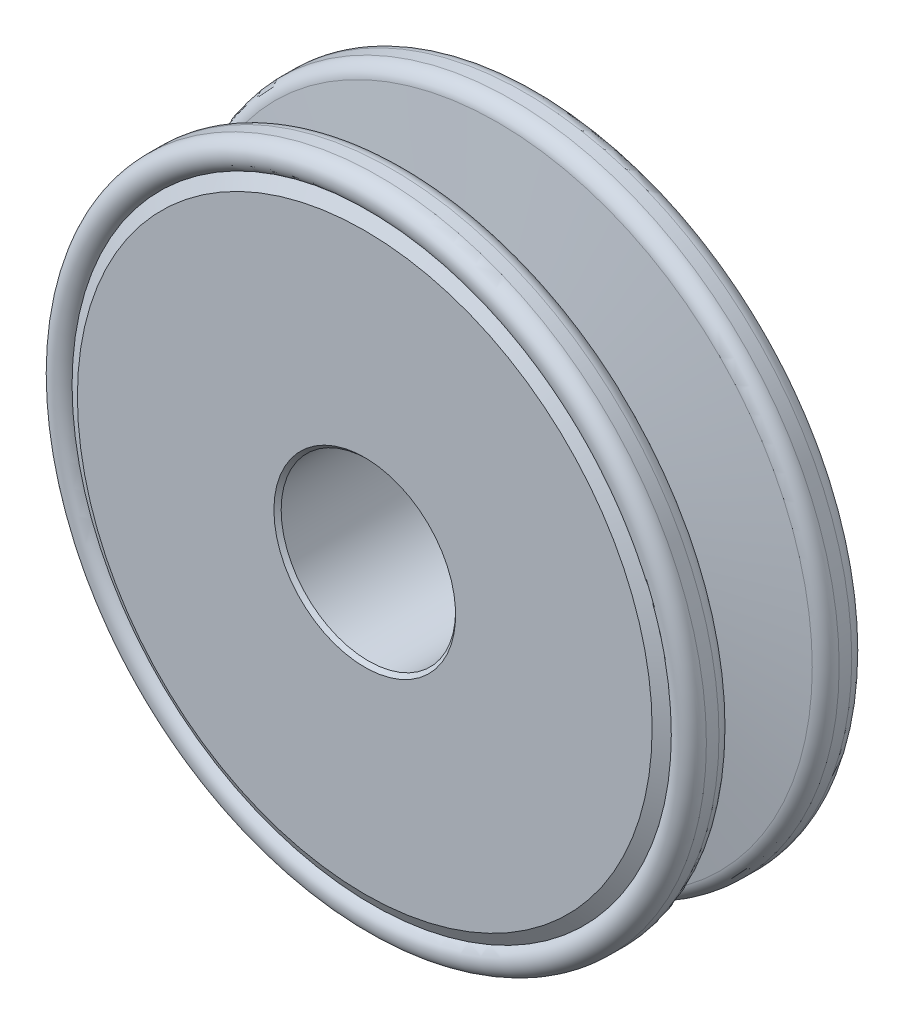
ISO-10303-21;
HEADER;
FILE_DESCRIPTION(('STEP AP214'),'2;1');
FILE_NAME('part.step','',(''),(''),'','','');
FILE_SCHEMA(('AUTOMOTIVE_DESIGN { 1 0 10303 214 1 1 1 1 }'));
ENDSEC;
DATA;
#1=APPLICATION_CONTEXT('core data for automotive mechanical design processes');
#2=APPLICATION_PROTOCOL_DEFINITION('international standard','automotive_design',2000,#1);
#3=PRODUCT_CONTEXT('',#1,'mechanical');
#4=PRODUCT('Part','Part','',(#3));
#5=PRODUCT_RELATED_PRODUCT_CATEGORY('part','',(#4));
#6=PRODUCT_DEFINITION_FORMATION('','',#4);
#7=PRODUCT_DEFINITION_CONTEXT('part definition',#1,'design');
#8=PRODUCT_DEFINITION('design','',#6,#7);
#9=PRODUCT_DEFINITION_SHAPE('','',#8);
#10=(LENGTH_UNIT() NAMED_UNIT(*) SI_UNIT(.MILLI.,.METRE.));
#11=(NAMED_UNIT(*) PLANE_ANGLE_UNIT() SI_UNIT($,.RADIAN.));
#12=(NAMED_UNIT(*) SI_UNIT($,.STERADIAN.) SOLID_ANGLE_UNIT());
#13=UNCERTAINTY_MEASURE_WITH_UNIT(LENGTH_MEASURE(1.E-05),#10,'distance_accuracy_value','');
#14=(GEOMETRIC_REPRESENTATION_CONTEXT(3) GLOBAL_UNCERTAINTY_ASSIGNED_CONTEXT((#13)) GLOBAL_UNIT_ASSIGNED_CONTEXT((#10,
#11,#12)) REPRESENTATION_CONTEXT('',''));
#15=CARTESIAN_POINT('',(0.,0.,0.));
#16=DIRECTION('',(0.,0.,1.));
#17=DIRECTION('',(1.,0.,0.));
#18=AXIS2_PLACEMENT_3D('',#15,#16,#17);
#19=CARTESIAN_POINT('',(0.,6.,6.));
#20=DIRECTION('',(0.,0.,-1.));
#21=DIRECTION('',(-1.,0.,0.));
#22=AXIS2_PLACEMENT_3D('',#19,#20,#21);
#23=PLANE('',#22);
#24=CARTESIAN_POINT('',(0.,0.,6.));
#25=DIRECTION('',(0.,0.,-1.));
#26=DIRECTION('',(-1.,0.,0.));
#27=AXIS2_PLACEMENT_3D('',#24,#25,#26);
#28=CIRCLE('',#27,6.24999999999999);
#29=CARTESIAN_POINT('',(-6.24999999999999,0.,6.));
#30=VERTEX_POINT('',#29);
#31=EDGE_CURVE('E36',#30,#30,#28,.T.);
#32=ORIENTED_EDGE('',*,*,#31,.T.);
#33=EDGE_LOOP('',(#32));
#34=FACE_BOUND('',#33,.T.);
#35=CARTESIAN_POINT('',(0.,0.,6.));
#36=DIRECTION('',(0.,0.,1.));
#37=DIRECTION('',(1.,0.,0.));
#38=AXIS2_PLACEMENT_3D('',#35,#36,#37);
#39=CIRCLE('',#38,19.7679491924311);
#40=CARTESIAN_POINT('',(19.7679491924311,0.,6.));
#41=VERTEX_POINT('',#40);
#42=EDGE_CURVE('E82',#41,#41,#39,.T.);
#43=ORIENTED_EDGE('',*,*,#42,.T.);
#44=EDGE_LOOP('',(#43));
#45=FACE_BOUND('',#44,.T.);
#46=ADVANCED_FACE('F29',(#34,#45),#23,.F.);
#47=CARTESIAN_POINT('',(0.,0.,6.));
#48=DIRECTION('',(0.,0.,1.));
#49=DIRECTION('',(1.,0.,0.));
#50=AXIS2_PLACEMENT_3D('',#47,#48,#49);
#51=CYLINDRICAL_SURFACE('',#50,6.);
#52=CARTESIAN_POINT('',(0.,0.,5.75000000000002));
#53=DIRECTION('',(0.,0.,-1.));
#54=DIRECTION('',(-1.,0.,0.));
#55=AXIS2_PLACEMENT_3D('',#52,#53,#54);
#56=CIRCLE('',#55,6.);
#57=CARTESIAN_POINT('',(-6.,0.,5.75000000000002));
#58=VERTEX_POINT('',#57);
#59=EDGE_CURVE('E40',#58,#58,#56,.F.);
#60=ORIENTED_EDGE('',*,*,#59,.T.);
#61=EDGE_LOOP('',(#60));
#62=FACE_BOUND('',#61,.T.);
#63=CARTESIAN_POINT('',(0.,0.,-5.75));
#64=DIRECTION('',(0.,0.,1.));
#65=DIRECTION('',(1.,0.,0.));
#66=AXIS2_PLACEMENT_3D('',#63,#64,#65);
#67=CIRCLE('',#66,6.);
#68=CARTESIAN_POINT('',(6.,0.,-5.75));
#69=VERTEX_POINT('',#68);
#70=EDGE_CURVE('E44',#69,#69,#67,.F.);
#71=ORIENTED_EDGE('',*,*,#70,.T.);
#72=EDGE_LOOP('',(#71));
#73=FACE_BOUND('',#72,.T.);
#74=ADVANCED_FACE('F156',(#62,#73),#51,.F.);
#75=CARTESIAN_POINT('',(0.,6.,-6.));
#76=DIRECTION('',(0.,0.,1.));
#77=DIRECTION('',(1.,0.,0.));
#78=AXIS2_PLACEMENT_3D('',#75,#76,#77);
#79=PLANE('',#78);
#80=CARTESIAN_POINT('',(0.,0.,-6.));
#81=DIRECTION('',(0.,0.,1.));
#82=DIRECTION('',(1.,0.,0.));
#83=AXIS2_PLACEMENT_3D('',#80,#81,#82);
#84=CIRCLE('',#83,6.25);
#85=CARTESIAN_POINT('',(6.25,0.,-6.));
#86=VERTEX_POINT('',#85);
#87=EDGE_CURVE('E10',#86,#86,#84,.T.);
#88=ORIENTED_EDGE('',*,*,#87,.T.);
#89=EDGE_LOOP('',(#88));
#90=FACE_BOUND('',#89,.T.);
#91=CARTESIAN_POINT('',(0.,0.,-6.));
#92=DIRECTION('',(0.,0.,1.));
#93=DIRECTION('',(1.,0.,0.));
#94=AXIS2_PLACEMENT_3D('',#91,#92,#93);
#95=CIRCLE('',#94,19.7679491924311);
#96=CARTESIAN_POINT('',(19.7679491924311,0.,-6.));
#97=VERTEX_POINT('',#96);
#98=EDGE_CURVE('E49',#97,#97,#95,.T.);
#99=ORIENTED_EDGE('',*,*,#98,.F.);
#100=EDGE_LOOP('',(#99));
#101=FACE_BOUND('',#100,.T.);
#102=ADVANCED_FACE('F151',(#90,#101),#79,.F.);
#103=CARTESIAN_POINT('',(0.,0.,-6.));
#104=DIRECTION('',(0.,0.,1.));
#105=DIRECTION('',(1.,0.,0.));
#106=AXIS2_PLACEMENT_3D('',#103,#104,#105);
#107=CONICAL_SURFACE('',#106,19.7679491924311,1.0471975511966);
#108=CARTESIAN_POINT('',(0.,0.,-5.5));
#109=DIRECTION('',(0.,0.,1.));
#110=DIRECTION('',(1.,0.,0.));
#111=AXIS2_PLACEMENT_3D('',#108,#109,#110);
#112=CIRCLE('',#111,20.6339745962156);
#113=CARTESIAN_POINT('',(20.6339745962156,0.,-5.5));
#114=VERTEX_POINT('',#113);
#115=EDGE_CURVE('E52',#114,#114,#112,.T.);
#116=ORIENTED_EDGE('',*,*,#115,.F.);
#117=EDGE_LOOP('',(#116));
#118=FACE_BOUND('',#117,.T.);
#119=ORIENTED_EDGE('',*,*,#98,.T.);
#120=EDGE_LOOP('',(#119));
#121=FACE_BOUND('',#120,.T.);
#122=ADVANCED_FACE('F145',(#118,#121),#107,.T.);
#123=CARTESIAN_POINT('',(0.,0.,-5.));
#124=DIRECTION('',(0.,0.,1.));
#125=DIRECTION('',(1.,0.,0.));
#126=AXIS2_PLACEMENT_3D('',#123,#124,#125);
#127=TOROIDAL_SURFACE('',#126,21.5,1.);
#128=CARTESIAN_POINT('',(0.,0.,-5.));
#129=DIRECTION('',(0.,0.,1.));
#130=DIRECTION('',(1.,0.,0.));
#131=AXIS2_PLACEMENT_3D('',#128,#129,#130);
#132=CIRCLE('',#131,22.5);
#133=CARTESIAN_POINT('',(22.5,0.,-5.));
#134=VERTEX_POINT('',#133);
#135=EDGE_CURVE('E55',#134,#134,#132,.T.);
#136=ORIENTED_EDGE('',*,*,#135,.F.);
#137=EDGE_LOOP('',(#136));
#138=FACE_BOUND('',#137,.T.);
#139=ORIENTED_EDGE('',*,*,#115,.T.);
#140=EDGE_LOOP('',(#139));
#141=FACE_BOUND('',#140,.T.);
#142=ADVANCED_FACE('F139',(#138,#141),#127,.T.);
#143=CARTESIAN_POINT('',(0.,0.,6.));
#144=DIRECTION('',(0.,0.,1.));
#145=DIRECTION('',(1.,0.,0.));
#146=AXIS2_PLACEMENT_3D('',#143,#144,#145);
#147=CYLINDRICAL_SURFACE('',#146,22.5);
#148=CARTESIAN_POINT('',(0.,0.,-4.13415425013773));
#149=DIRECTION('',(0.,0.,1.));
#150=DIRECTION('',(1.,0.,0.));
#151=AXIS2_PLACEMENT_3D('',#148,#149,#150);
#152=CIRCLE('',#151,22.5);
#153=CARTESIAN_POINT('',(22.5,0.,-4.13415425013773));
#154=VERTEX_POINT('',#153);
#155=EDGE_CURVE('E58',#154,#154,#152,.T.);
#156=ORIENTED_EDGE('',*,*,#155,.F.);
#157=EDGE_LOOP('',(#156));
#158=FACE_BOUND('',#157,.T.);
#159=ORIENTED_EDGE('',*,*,#135,.T.);
#160=EDGE_LOOP('',(#159));
#161=FACE_BOUND('',#160,.T.);
#162=ADVANCED_FACE('F133',(#158,#161),#147,.T.);
#163=CARTESIAN_POINT('',(0.,0.,-4.13415425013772));
#164=DIRECTION('',(0.,0.,1.));
#165=DIRECTION('',(1.,0.,0.));
#166=AXIS2_PLACEMENT_3D('',#163,#164,#165);
#167=TOROIDAL_SURFACE('',#166,21.5,1.);
#168=CARTESIAN_POINT('',(0.,0.,-3.14388618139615));
#169=DIRECTION('',(0.,0.,1.));
#170=DIRECTION('',(1.,0.,0.));
#171=AXIS2_PLACEMENT_3D('',#168,#169,#170);
#172=CIRCLE('',#171,21.6391731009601);
#173=CARTESIAN_POINT('',(21.6391731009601,0.,-3.14388618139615));
#174=VERTEX_POINT('',#173);
#175=EDGE_CURVE('E61',#174,#174,#172,.T.);
#176=ORIENTED_EDGE('',*,*,#175,.F.);
#177=EDGE_LOOP('',(#176));
#178=FACE_BOUND('',#177,.T.);
#179=ORIENTED_EDGE('',*,*,#155,.T.);
#180=EDGE_LOOP('',(#179));
#181=FACE_BOUND('',#180,.T.);
#182=ADVANCED_FACE('F127',(#178,#181),#167,.T.);
#183=CARTESIAN_POINT('',(0.,0.,-3.14388618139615));
#184=DIRECTION('',(0.,0.,-1.));
#185=DIRECTION('',(-1.,0.,0.));
#186=AXIS2_PLACEMENT_3D('',#183,#184,#185);
#187=CONICAL_SURFACE('',#186,21.6391731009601,1.43116998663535);
#188=CARTESIAN_POINT('',(0.,0.,-2.));
#189=DIRECTION('',(0.,0.,1.));
#190=DIRECTION('',(1.,0.,0.));
#191=AXIS2_PLACEMENT_3D('',#188,#189,#190);
#192=CIRCLE('',#191,13.5);
#193=CARTESIAN_POINT('',(13.5,0.,-2.));
#194=VERTEX_POINT('',#193);
#195=EDGE_CURVE('E64',#194,#194,#192,.T.);
#196=ORIENTED_EDGE('',*,*,#195,.F.);
#197=EDGE_LOOP('',(#196));
#198=FACE_BOUND('',#197,.T.);
#199=ORIENTED_EDGE('',*,*,#175,.T.);
#200=EDGE_LOOP('',(#199));
#201=FACE_BOUND('',#200,.T.);
#202=ADVANCED_FACE('F121',(#198,#201),#187,.T.);
#203=CARTESIAN_POINT('',(0.,0.,6.));
#204=DIRECTION('',(0.,0.,1.));
#205=DIRECTION('',(1.,0.,0.));
#206=AXIS2_PLACEMENT_3D('',#203,#204,#205);
#207=CYLINDRICAL_SURFACE('',#206,13.5);
#208=CARTESIAN_POINT('',(0.,0.,2.));
#209=DIRECTION('',(0.,0.,1.));
#210=DIRECTION('',(1.,0.,0.));
#211=AXIS2_PLACEMENT_3D('',#208,#209,#210);
#212=CIRCLE('',#211,13.5);
#213=CARTESIAN_POINT('',(13.5,0.,2.));
#214=VERTEX_POINT('',#213);
#215=EDGE_CURVE('E67',#214,#214,#212,.T.);
#216=ORIENTED_EDGE('',*,*,#215,.F.);
#217=EDGE_LOOP('',(#216));
#218=FACE_BOUND('',#217,.T.);
#219=ORIENTED_EDGE('',*,*,#195,.T.);
#220=EDGE_LOOP('',(#219));
#221=FACE_BOUND('',#220,.T.);
#222=ADVANCED_FACE('F115',(#218,#221),#207,.T.);
#223=CARTESIAN_POINT('',(0.,0.,2.));
#224=DIRECTION('',(0.,0.,1.));
#225=DIRECTION('',(1.,0.,0.));
#226=AXIS2_PLACEMENT_3D('',#223,#224,#225);
#227=CONICAL_SURFACE('',#226,13.5,1.43116998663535);
#228=CARTESIAN_POINT('',(0.,0.,3.14388618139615));
#229=DIRECTION('',(0.,0.,1.));
#230=DIRECTION('',(1.,0.,0.));
#231=AXIS2_PLACEMENT_3D('',#228,#229,#230);
#232=CIRCLE('',#231,21.6391731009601);
#233=CARTESIAN_POINT('',(21.6391731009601,0.,3.14388618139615));
#234=VERTEX_POINT('',#233);
#235=EDGE_CURVE('E70',#234,#234,#232,.T.);
#236=ORIENTED_EDGE('',*,*,#235,.F.);
#237=EDGE_LOOP('',(#236));
#238=FACE_BOUND('',#237,.T.);
#239=ORIENTED_EDGE('',*,*,#215,.T.);
#240=EDGE_LOOP('',(#239));
#241=FACE_BOUND('',#240,.T.);
#242=ADVANCED_FACE('F109',(#238,#241),#227,.T.);
#243=CARTESIAN_POINT('',(0.,0.,4.13415425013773));
#244=DIRECTION('',(0.,0.,1.));
#245=DIRECTION('',(1.,0.,0.));
#246=AXIS2_PLACEMENT_3D('',#243,#244,#245);
#247=TOROIDAL_SURFACE('',#246,21.5,1.);
#248=CARTESIAN_POINT('',(0.,0.,4.13415425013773));
#249=DIRECTION('',(0.,0.,1.));
#250=DIRECTION('',(1.,0.,0.));
#251=AXIS2_PLACEMENT_3D('',#248,#249,#250);
#252=CIRCLE('',#251,22.5);
#253=CARTESIAN_POINT('',(22.5,0.,4.13415425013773));
#254=VERTEX_POINT('',#253);
#255=EDGE_CURVE('E73',#254,#254,#252,.T.);
#256=ORIENTED_EDGE('',*,*,#255,.F.);
#257=EDGE_LOOP('',(#256));
#258=FACE_BOUND('',#257,.T.);
#259=ORIENTED_EDGE('',*,*,#235,.T.);
#260=EDGE_LOOP('',(#259));
#261=FACE_BOUND('',#260,.T.);
#262=ADVANCED_FACE('F103',(#258,#261),#247,.T.);
#263=CARTESIAN_POINT('',(0.,0.,6.));
#264=DIRECTION('',(0.,0.,1.));
#265=DIRECTION('',(1.,0.,0.));
#266=AXIS2_PLACEMENT_3D('',#263,#264,#265);
#267=CYLINDRICAL_SURFACE('',#266,22.5);
#268=CARTESIAN_POINT('',(0.,0.,5.));
#269=DIRECTION('',(0.,0.,1.));
#270=DIRECTION('',(1.,0.,0.));
#271=AXIS2_PLACEMENT_3D('',#268,#269,#270);
#272=CIRCLE('',#271,22.5);
#273=CARTESIAN_POINT('',(22.5,0.,5.));
#274=VERTEX_POINT('',#273);
#275=EDGE_CURVE('E76',#274,#274,#272,.T.);
#276=ORIENTED_EDGE('',*,*,#275,.F.);
#277=EDGE_LOOP('',(#276));
#278=FACE_BOUND('',#277,.T.);
#279=ORIENTED_EDGE('',*,*,#255,.T.);
#280=EDGE_LOOP('',(#279));
#281=FACE_BOUND('',#280,.T.);
#282=ADVANCED_FACE('F97',(#278,#281),#267,.T.);
#283=CARTESIAN_POINT('',(0.,0.,5.));
#284=DIRECTION('',(0.,0.,1.));
#285=DIRECTION('',(1.,0.,0.));
#286=AXIS2_PLACEMENT_3D('',#283,#284,#285);
#287=TOROIDAL_SURFACE('',#286,21.5,1.);
#288=CARTESIAN_POINT('',(0.,0.,5.5));
#289=DIRECTION('',(0.,0.,1.));
#290=DIRECTION('',(1.,0.,0.));
#291=AXIS2_PLACEMENT_3D('',#288,#289,#290);
#292=CIRCLE('',#291,20.6339745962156);
#293=CARTESIAN_POINT('',(20.6339745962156,0.,5.5));
#294=VERTEX_POINT('',#293);
#295=EDGE_CURVE('E79',#294,#294,#292,.T.);
#296=ORIENTED_EDGE('',*,*,#295,.F.);
#297=EDGE_LOOP('',(#296));
#298=FACE_BOUND('',#297,.T.);
#299=ORIENTED_EDGE('',*,*,#275,.T.);
#300=EDGE_LOOP('',(#299));
#301=FACE_BOUND('',#300,.T.);
#302=ADVANCED_FACE('F91',(#298,#301),#287,.T.);
#303=CARTESIAN_POINT('',(0.,0.,5.5));
#304=DIRECTION('',(0.,0.,-1.));
#305=DIRECTION('',(-1.,0.,0.));
#306=AXIS2_PLACEMENT_3D('',#303,#304,#305);
#307=CONICAL_SURFACE('',#306,20.6339745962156,1.0471975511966);
#308=ORIENTED_EDGE('',*,*,#42,.F.);
#309=EDGE_LOOP('',(#308));
#310=FACE_BOUND('',#309,.T.);
#311=ORIENTED_EDGE('',*,*,#295,.T.);
#312=EDGE_LOOP('',(#311));
#313=FACE_BOUND('',#312,.T.);
#314=ADVANCED_FACE('F87',(#310,#313),#307,.T.);
#315=CARTESIAN_POINT('',(0.,0.,5.75000000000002));
#316=DIRECTION('',(0.,0.,1.));
#317=DIRECTION('',(1.,0.,0.));
#318=AXIS2_PLACEMENT_3D('',#315,#316,#317);
#319=CONICAL_SURFACE('',#318,6.,0.785398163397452);
#320=ORIENTED_EDGE('',*,*,#31,.F.);
#321=EDGE_LOOP('',(#320));
#322=FACE_BOUND('',#321,.T.);
#323=ORIENTED_EDGE('',*,*,#59,.F.);
#324=EDGE_LOOP('',(#323));
#325=FACE_BOUND('',#324,.T.);
#326=ADVANCED_FACE('F90',(#322,#325),#319,.F.);
#327=CARTESIAN_POINT('',(0.,0.,-6.));
#328=DIRECTION('',(0.,0.,-1.));
#329=DIRECTION('',(-1.,0.,0.));
#330=AXIS2_PLACEMENT_3D('',#327,#328,#329);
#331=CONICAL_SURFACE('',#330,6.25,0.785398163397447);
#332=ORIENTED_EDGE('',*,*,#70,.F.);
#333=EDGE_LOOP('',(#332));
#334=FACE_BOUND('',#333,.T.);
#335=ORIENTED_EDGE('',*,*,#87,.F.);
#336=EDGE_LOOP('',(#335));
#337=FACE_BOUND('',#336,.T.);
#338=ADVANCED_FACE('F31',(#334,#337),#331,.F.);
#339=CLOSED_SHELL('',(#46,#74,#102,#122,#142,#162,#182,#202,#222,#242,#262,#282,#302,#314,#326,#338));
#340=MANIFOLD_SOLID_BREP('B2',#339);
#341=ADVANCED_BREP_SHAPE_REPRESENTATION('',(#18,#340),#14);
#342=SHAPE_DEFINITION_REPRESENTATION(#9,#341);
ENDSEC;
END-ISO-10303-21;
